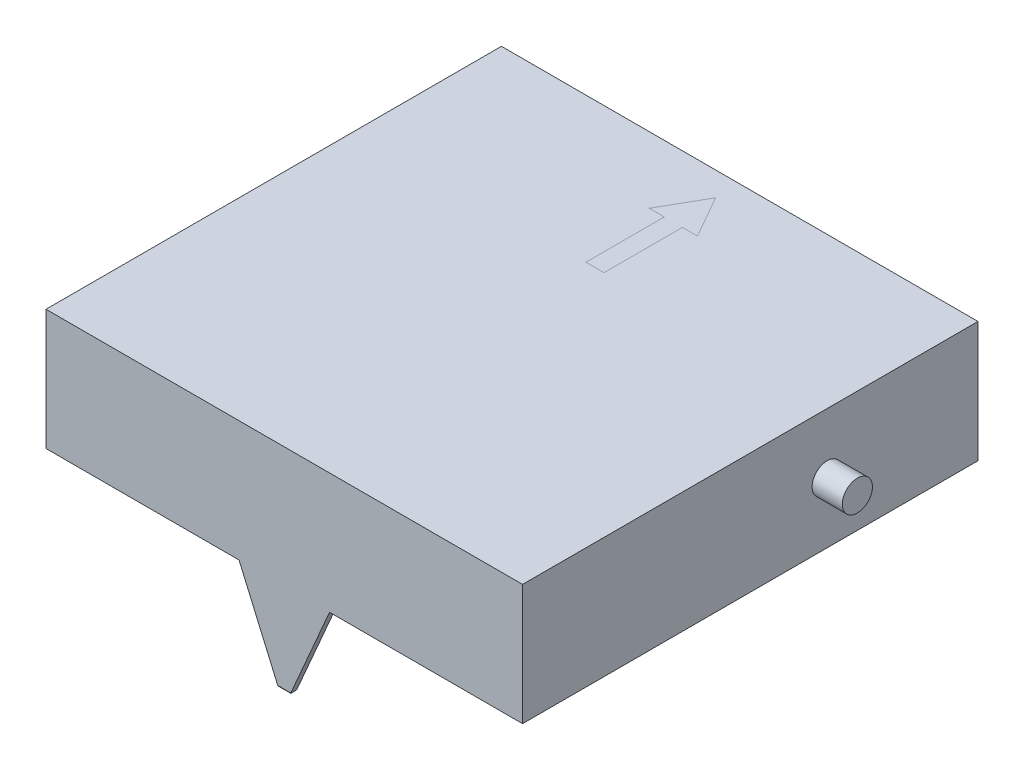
ISO-10303-21;
HEADER;
FILE_DESCRIPTION(('STEP AP214'),'2;1');
FILE_NAME('part.step','',(''),(''),'','','');
FILE_SCHEMA(('AUTOMOTIVE_DESIGN { 1 0 10303 214 1 1 1 1 }'));
ENDSEC;
DATA;
#1=APPLICATION_CONTEXT('core data for automotive mechanical design processes');
#2=APPLICATION_PROTOCOL_DEFINITION('international standard','automotive_design',2000,#1);
#3=PRODUCT_CONTEXT('',#1,'mechanical');
#4=PRODUCT('Part','Part','',(#3));
#5=PRODUCT_RELATED_PRODUCT_CATEGORY('part','',(#4));
#6=PRODUCT_DEFINITION_FORMATION('','',#4);
#7=PRODUCT_DEFINITION_CONTEXT('part definition',#1,'design');
#8=PRODUCT_DEFINITION('design','',#6,#7);
#9=PRODUCT_DEFINITION_SHAPE('','',#8);
#10=(LENGTH_UNIT() NAMED_UNIT(*) SI_UNIT(.MILLI.,.METRE.));
#11=(NAMED_UNIT(*) PLANE_ANGLE_UNIT() SI_UNIT($,.RADIAN.));
#12=(NAMED_UNIT(*) SI_UNIT($,.STERADIAN.) SOLID_ANGLE_UNIT());
#13=UNCERTAINTY_MEASURE_WITH_UNIT(LENGTH_MEASURE(1.E-05),#10,'distance_accuracy_value','');
#14=(GEOMETRIC_REPRESENTATION_CONTEXT(3) GLOBAL_UNCERTAINTY_ASSIGNED_CONTEXT((#13)) GLOBAL_UNIT_ASSIGNED_CONTEXT((#10,
#11,#12)) REPRESENTATION_CONTEXT('',''));
#15=CARTESIAN_POINT('',(0.,0.,0.));
#16=DIRECTION('',(0.,0.,1.));
#17=DIRECTION('',(1.,0.,0.));
#18=AXIS2_PLACEMENT_3D('',#15,#16,#17);
#19=CARTESIAN_POINT('',(0.,20.,0.));
#20=DIRECTION('',(0.,-1.,0.));
#21=DIRECTION('',(0.,0.,-1.));
#22=AXIS2_PLACEMENT_3D('',#19,#20,#21);
#23=PLANE('',#22);
#24=DIRECTION('',(0.,0.,1.));
#25=VECTOR('',#24,1.);
#26=CARTESIAN_POINT('',(0.,20.,0.));
#27=LINE('',#26,#25);
#28=CARTESIAN_POINT('',(0.,20.,-75.5));
#29=VERTEX_POINT('',#28);
#30=CARTESIAN_POINT('',(0.,20.,0.));
#31=VERTEX_POINT('',#30);
#32=EDGE_CURVE('E195',#29,#31,#27,.T.);
#33=ORIENTED_EDGE('',*,*,#32,.T.);
#34=DIRECTION('',(1.,0.,0.));
#35=VECTOR('',#34,1.);
#36=CARTESIAN_POINT('',(0.,20.,0.));
#37=LINE('',#36,#35);
#38=CARTESIAN_POINT('',(79.,20.,0.));
#39=VERTEX_POINT('',#38);
#40=EDGE_CURVE('E199',#31,#39,#37,.T.);
#41=ORIENTED_EDGE('',*,*,#40,.T.);
#42=DIRECTION('',(0.,0.,-1.));
#43=VECTOR('',#42,1.);
#44=CARTESIAN_POINT('',(79.,20.,0.));
#45=LINE('',#44,#43);
#46=CARTESIAN_POINT('',(79.,20.,-75.5));
#47=VERTEX_POINT('',#46);
#48=EDGE_CURVE('E203',#39,#47,#45,.T.);
#49=ORIENTED_EDGE('',*,*,#48,.T.);
#50=DIRECTION('',(-1.,0.,0.));
#51=VECTOR('',#50,1.);
#52=CARTESIAN_POINT('',(0.,20.,-75.5));
#53=LINE('',#52,#51);
#54=EDGE_CURVE('E206',#47,#29,#53,.T.);
#55=ORIENTED_EDGE('',*,*,#54,.T.);
#56=EDGE_LOOP('',(#33,#41,#49,#55));
#57=FACE_BOUND('',#56,.T.);
#58=DIRECTION('',(1.,0.,0.));
#59=VECTOR('',#58,1.);
#60=CARTESIAN_POINT('',(0.,20.,-51.5));
#61=LINE('',#60,#59);
#62=CARTESIAN_POINT('',(38.,20.,-51.5));
#63=VERTEX_POINT('',#62);
#64=CARTESIAN_POINT('',(41.,20.,-51.5));
#65=VERTEX_POINT('',#64);
#66=EDGE_CURVE('E261',#63,#65,#61,.T.);
#67=ORIENTED_EDGE('',*,*,#66,.F.);
#68=DIRECTION('',(0.,0.,1.));
#69=VECTOR('',#68,1.);
#70=CARTESIAN_POINT('',(38.,20.,0.));
#71=LINE('',#70,#69);
#72=CARTESIAN_POINT('',(38.,20.,-64.5));
#73=VERTEX_POINT('',#72);
#74=EDGE_CURVE('E237',#73,#63,#71,.T.);
#75=ORIENTED_EDGE('',*,*,#74,.F.);
#76=DIRECTION('',(1.,0.,0.));
#77=VECTOR('',#76,1.);
#78=CARTESIAN_POINT('',(0.,20.,-64.5));
#79=LINE('',#78,#77);
#80=CARTESIAN_POINT('',(35.5,20.,-64.5));
#81=VERTEX_POINT('',#80);
#82=EDGE_CURVE('E246',#81,#73,#79,.T.);
#83=ORIENTED_EDGE('',*,*,#82,.F.);
#84=DIRECTION('',(-0.496138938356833,0.,0.86824314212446));
#85=VECTOR('',#84,1.);
#86=CARTESIAN_POINT('',(-1.02307692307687,20.,-0.584615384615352));
#87=LINE('',#86,#85);
#88=CARTESIAN_POINT('',(39.5,20.,-71.5));
#89=VERTEX_POINT('',#88);
#90=EDGE_CURVE('E249',#89,#81,#87,.T.);
#91=ORIENTED_EDGE('',*,*,#90,.F.);
#92=DIRECTION('',(-0.496138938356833,0.,-0.86824314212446));
#93=VECTOR('',#92,1.);
#94=CARTESIAN_POINT('',(60.5769230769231,20.,-34.6153846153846));
#95=LINE('',#94,#93);
#96=CARTESIAN_POINT('',(43.5,20.,-64.5));
#97=VERTEX_POINT('',#96);
#98=EDGE_CURVE('E252',#97,#89,#95,.T.);
#99=ORIENTED_EDGE('',*,*,#98,.F.);
#100=DIRECTION('',(1.,0.,0.));
#101=VECTOR('',#100,1.);
#102=CARTESIAN_POINT('',(0.,20.,-64.5));
#103=LINE('',#102,#101);
#104=CARTESIAN_POINT('',(41.,20.,-64.5));
#105=VERTEX_POINT('',#104);
#106=EDGE_CURVE('E255',#105,#97,#103,.T.);
#107=ORIENTED_EDGE('',*,*,#106,.F.);
#108=DIRECTION('',(0.,0.,-1.));
#109=VECTOR('',#108,1.);
#110=CARTESIAN_POINT('',(41.,20.,0.));
#111=LINE('',#110,#109);
#112=EDGE_CURVE('E258',#65,#105,#111,.T.);
#113=ORIENTED_EDGE('',*,*,#112,.F.);
#114=EDGE_LOOP('',(#67,#75,#83,#91,#99,#107,#113));
#115=FACE_BOUND('',#114,.T.);
#116=ADVANCED_FACE('F45',(#57,#115),#23,.F.);
#117=CARTESIAN_POINT('',(0.,20.,0.));
#118=DIRECTION('',(1.,0.,0.));
#119=DIRECTION('',(0.,0.,-1.));
#120=AXIS2_PLACEMENT_3D('',#117,#118,#119);
#121=PLANE('',#120);
#122=CARTESIAN_POINT('',(0.,10.,-50.5));
#123=DIRECTION('',(1.,0.,0.));
#124=DIRECTION('',(0.,0.,-1.));
#125=AXIS2_PLACEMENT_3D('',#122,#123,#124);
#126=CIRCLE('',#125,2.5);
#127=CARTESIAN_POINT('',(0.,10.,-53.));
#128=VERTEX_POINT('',#127);
#129=EDGE_CURVE('E185',#128,#128,#126,.T.);
#130=ORIENTED_EDGE('',*,*,#129,.T.);
#131=EDGE_LOOP('',(#130));
#132=FACE_BOUND('',#131,.T.);
#133=DIRECTION('',(0.,0.,1.));
#134=VECTOR('',#133,1.);
#135=CARTESIAN_POINT('',(0.,0.,0.));
#136=LINE('',#135,#134);
#137=CARTESIAN_POINT('',(0.,0.,-75.5));
#138=VERTEX_POINT('',#137);
#139=CARTESIAN_POINT('',(0.,0.,0.));
#140=VERTEX_POINT('',#139);
#141=EDGE_CURVE('E193',#138,#140,#136,.T.);
#142=ORIENTED_EDGE('',*,*,#141,.T.);
#143=DIRECTION('',(0.,-1.,0.));
#144=VECTOR('',#143,1.);
#145=CARTESIAN_POINT('',(0.,20.,0.));
#146=LINE('',#145,#144);
#147=EDGE_CURVE('E233',#31,#140,#146,.T.);
#148=ORIENTED_EDGE('',*,*,#147,.F.);
#149=ORIENTED_EDGE('',*,*,#32,.F.);
#150=DIRECTION('',(0.,-1.,0.));
#151=VECTOR('',#150,1.);
#152=CARTESIAN_POINT('',(0.,20.,-75.5));
#153=LINE('',#152,#151);
#154=EDGE_CURVE('E209',#29,#138,#153,.T.);
#155=ORIENTED_EDGE('',*,*,#154,.T.);
#156=EDGE_LOOP('',(#142,#148,#149,#155));
#157=FACE_BOUND('',#156,.T.);
#158=ADVANCED_FACE('F333',(#132,#157),#121,.F.);
#159=CARTESIAN_POINT('',(0.,20.,0.));
#160=DIRECTION('',(0.,0.,-1.));
#161=DIRECTION('',(-1.,0.,0.));
#162=AXIS2_PLACEMENT_3D('',#159,#160,#161);
#163=PLANE('',#162);
#164=DIRECTION('',(0.3976074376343,-0.917555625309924,0.));
#165=VECTOR('',#164,1.);
#166=CARTESIAN_POINT('',(32.,0.,0.));
#167=LINE('',#166,#165);
#168=CARTESIAN_POINT('',(32.,0.,0.));
#169=VERTEX_POINT('',#168);
#170=CARTESIAN_POINT('',(38.3916666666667,-14.75,0.));
#171=VERTEX_POINT('',#170);
#172=EDGE_CURVE('E158',#169,#171,#167,.T.);
#173=ORIENTED_EDGE('',*,*,#172,.T.);
#174=DIRECTION('',(1.,0.,0.));
#175=VECTOR('',#174,1.);
#176=CARTESIAN_POINT('',(40.5,-14.75,0.));
#177=LINE('',#176,#175);
#178=CARTESIAN_POINT('',(40.6083333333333,-14.75,0.));
#179=VERTEX_POINT('',#178);
#180=EDGE_CURVE('E12',#171,#179,#177,.T.);
#181=ORIENTED_EDGE('',*,*,#180,.T.);
#182=DIRECTION('',(0.3976074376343,0.917555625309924,0.));
#183=VECTOR('',#182,1.);
#184=CARTESIAN_POINT('',(40.5,-15.,0.));
#185=LINE('',#184,#183);
#186=CARTESIAN_POINT('',(47.,0.,0.));
#187=VERTEX_POINT('',#186);
#188=EDGE_CURVE('E180',#179,#187,#185,.T.);
#189=ORIENTED_EDGE('',*,*,#188,.T.);
#190=DIRECTION('',(1.,0.,0.));
#191=VECTOR('',#190,1.);
#192=CARTESIAN_POINT('',(0.,0.,0.));
#193=LINE('',#192,#191);
#194=CARTESIAN_POINT('',(79.,0.,0.));
#195=VERTEX_POINT('',#194);
#196=EDGE_CURVE('E213',#187,#195,#193,.T.);
#197=ORIENTED_EDGE('',*,*,#196,.T.);
#198=DIRECTION('',(0.,-1.,0.));
#199=VECTOR('',#198,1.);
#200=CARTESIAN_POINT('',(79.,20.,0.));
#201=LINE('',#200,#199);
#202=EDGE_CURVE('E229',#39,#195,#201,.T.);
#203=ORIENTED_EDGE('',*,*,#202,.F.);
#204=ORIENTED_EDGE('',*,*,#40,.F.);
#205=ORIENTED_EDGE('',*,*,#147,.T.);
#206=EDGE_CURVE('E214',#140,#169,#193,.T.);
#207=ORIENTED_EDGE('',*,*,#206,.T.);
#208=EDGE_LOOP('',(#173,#181,#189,#197,#203,#204,#205,#207));
#209=FACE_BOUND('',#208,.T.);
#210=ADVANCED_FACE('F336',(#209),#163,.F.);
#211=CARTESIAN_POINT('',(79.,20.,0.));
#212=DIRECTION('',(-1.,0.,0.));
#213=DIRECTION('',(0.,0.,1.));
#214=AXIS2_PLACEMENT_3D('',#211,#212,#213);
#215=PLANE('',#214);
#216=CARTESIAN_POINT('',(79.,10.,-50.5));
#217=DIRECTION('',(-1.,0.,0.));
#218=DIRECTION('',(0.,0.,1.));
#219=AXIS2_PLACEMENT_3D('',#216,#217,#218);
#220=CIRCLE('',#219,2.5);
#221=CARTESIAN_POINT('',(79.,10.,-48.));
#222=VERTEX_POINT('',#221);
#223=EDGE_CURVE('E238',#222,#222,#220,.T.);
#224=ORIENTED_EDGE('',*,*,#223,.T.);
#225=EDGE_LOOP('',(#224));
#226=FACE_BOUND('',#225,.T.);
#227=DIRECTION('',(0.,0.,-1.));
#228=VECTOR('',#227,1.);
#229=CARTESIAN_POINT('',(79.,0.,0.));
#230=LINE('',#229,#228);
#231=CARTESIAN_POINT('',(79.,0.,-75.5));
#232=VERTEX_POINT('',#231);
#233=EDGE_CURVE('E217',#195,#232,#230,.T.);
#234=ORIENTED_EDGE('',*,*,#233,.T.);
#235=DIRECTION('',(0.,-1.,0.));
#236=VECTOR('',#235,1.);
#237=CARTESIAN_POINT('',(79.,20.,-75.5));
#238=LINE('',#237,#236);
#239=EDGE_CURVE('E225',#47,#232,#238,.T.);
#240=ORIENTED_EDGE('',*,*,#239,.F.);
#241=ORIENTED_EDGE('',*,*,#48,.F.);
#242=ORIENTED_EDGE('',*,*,#202,.T.);
#243=EDGE_LOOP('',(#234,#240,#241,#242));
#244=FACE_BOUND('',#243,.T.);
#245=ADVANCED_FACE('F354',(#226,#244),#215,.F.);
#246=CARTESIAN_POINT('',(0.,20.,-75.5));
#247=DIRECTION('',(0.,0.,1.));
#248=DIRECTION('',(1.,0.,0.));
#249=AXIS2_PLACEMENT_3D('',#246,#247,#248);
#250=PLANE('',#249);
#251=DIRECTION('',(-1.,0.,0.));
#252=VECTOR('',#251,1.);
#253=CARTESIAN_POINT('',(0.,0.,-75.5));
#254=LINE('',#253,#252);
#255=EDGE_CURVE('E200',#232,#138,#254,.T.);
#256=ORIENTED_EDGE('',*,*,#255,.T.);
#257=ORIENTED_EDGE('',*,*,#154,.F.);
#258=ORIENTED_EDGE('',*,*,#54,.F.);
#259=ORIENTED_EDGE('',*,*,#239,.T.);
#260=EDGE_LOOP('',(#256,#257,#258,#259));
#261=FACE_BOUND('',#260,.T.);
#262=ADVANCED_FACE('F352',(#261),#250,.F.);
#263=ORIENTED_EDGE('',*,*,#74,.T.);
#264=ORIENTED_EDGE('',*,*,#66,.T.);
#265=ORIENTED_EDGE('',*,*,#112,.T.);
#266=ORIENTED_EDGE('',*,*,#106,.T.);
#267=ORIENTED_EDGE('',*,*,#98,.T.);
#268=ORIENTED_EDGE('',*,*,#90,.T.);
#269=ORIENTED_EDGE('',*,*,#82,.T.);
#270=EDGE_LOOP('',(#263,#264,#265,#266,#267,#268,#269));
#271=FACE_BOUND('',#270,.T.);
#272=ADVANCED_FACE('F403',(#271),#23,.F.);
#273=CARTESIAN_POINT('',(0.,0.,0.));
#274=DIRECTION('',(0.,-1.,0.));
#275=DIRECTION('',(0.,0.,-1.));
#276=AXIS2_PLACEMENT_3D('',#273,#274,#275);
#277=PLANE('',#276);
#278=DIRECTION('',(0.,0.,1.));
#279=VECTOR('',#278,1.);
#280=CARTESIAN_POINT('',(47.,0.,-1.));
#281=LINE('',#280,#279);
#282=CARTESIAN_POINT('',(47.,0.,-1.));
#283=VERTEX_POINT('',#282);
#284=EDGE_CURVE('E163',#283,#187,#281,.T.);
#285=ORIENTED_EDGE('',*,*,#284,.F.);
#286=DIRECTION('',(-1.,0.,0.));
#287=VECTOR('',#286,1.);
#288=CARTESIAN_POINT('',(32.,0.,-1.));
#289=LINE('',#288,#287);
#290=CARTESIAN_POINT('',(32.,0.,-1.));
#291=VERTEX_POINT('',#290);
#292=EDGE_CURVE('E170',#283,#291,#289,.T.);
#293=ORIENTED_EDGE('',*,*,#292,.T.);
#294=DIRECTION('',(0.,0.,1.));
#295=VECTOR('',#294,1.);
#296=CARTESIAN_POINT('',(32.,0.,-1.));
#297=LINE('',#296,#295);
#298=EDGE_CURVE('E153',#291,#169,#297,.T.);
#299=ORIENTED_EDGE('',*,*,#298,.T.);
#300=ORIENTED_EDGE('',*,*,#206,.F.);
#301=ORIENTED_EDGE('',*,*,#141,.F.);
#302=ORIENTED_EDGE('',*,*,#255,.F.);
#303=ORIENTED_EDGE('',*,*,#233,.F.);
#304=ORIENTED_EDGE('',*,*,#196,.F.);
#305=EDGE_LOOP('',(#285,#293,#299,#300,#301,#302,#303,#304));
#306=FACE_BOUND('',#305,.T.);
#307=ADVANCED_FACE('F176',(#306),#277,.T.);
#308=CARTESIAN_POINT('',(40.5,-15.,-1.));
#309=DIRECTION('',(0.917555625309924,-0.3976074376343,0.));
#310=DIRECTION('',(0.397607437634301,0.917555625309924,0.));
#311=AXIS2_PLACEMENT_3D('',#308,#309,#310);
#312=PLANE('',#311);
#313=DIRECTION('',(0.,0.,1.));
#314=VECTOR('',#313,1.);
#315=CARTESIAN_POINT('',(40.5652591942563,-14.8494018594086,-1.));
#316=LINE('',#315,#314);
#317=CARTESIAN_POINT('',(40.5652591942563,-14.8494018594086,-0.0206110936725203));
#318=VERTEX_POINT('',#317);
#319=CARTESIAN_POINT('',(40.5652591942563,-14.8494018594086,-0.97938890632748));
#320=VERTEX_POINT('',#319);
#321=EDGE_CURVE('E280',#318,#320,#316,.F.);
#322=ORIENTED_EDGE('',*,*,#321,.T.);
#323=CARTESIAN_POINT('',(40.6083333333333,-14.75,-0.75));
#324=DIRECTION('',(0.917555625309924,-0.3976074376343,0.));
#325=DIRECTION('',(-0.397607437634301,-0.917555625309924,0.));
#326=AXIS2_PLACEMENT_3D('',#323,#324,#325);
#327=ELLIPSE('',#326,0.27246304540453,0.25);
#328=CARTESIAN_POINT('',(40.6083333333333,-14.75,-1.));
#329=VERTEX_POINT('',#328);
#330=EDGE_CURVE('E284',#320,#329,#327,.T.);
#331=ORIENTED_EDGE('',*,*,#330,.T.);
#332=DIRECTION('',(0.3976074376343,0.917555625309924,0.));
#333=VECTOR('',#332,1.);
#334=CARTESIAN_POINT('',(40.5,-15.,-1.));
#335=LINE('',#334,#333);
#336=EDGE_CURVE('E164',#329,#283,#335,.T.);
#337=ORIENTED_EDGE('',*,*,#336,.T.);
#338=ORIENTED_EDGE('',*,*,#284,.T.);
#339=ORIENTED_EDGE('',*,*,#188,.F.);
#340=CARTESIAN_POINT('',(40.6083333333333,-14.75,-0.25));
#341=DIRECTION('',(0.917555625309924,-0.3976074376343,0.));
#342=DIRECTION('',(-0.397607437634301,-0.917555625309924,0.));
#343=AXIS2_PLACEMENT_3D('',#340,#341,#342);
#344=ELLIPSE('',#343,0.27246304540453,0.25);
#345=EDGE_CURVE('E277',#179,#318,#344,.T.);
#346=ORIENTED_EDGE('',*,*,#345,.T.);
#347=EDGE_LOOP('',(#322,#331,#337,#338,#339,#346));
#348=FACE_BOUND('',#347,.T.);
#349=ADVANCED_FACE('F381',(#348),#312,.T.);
#350=CARTESIAN_POINT('',(38.5,-15.,-1.));
#351=DIRECTION('',(0.,-1.,0.));
#352=DIRECTION('',(0.,0.,-1.));
#353=AXIS2_PLACEMENT_3D('',#350,#351,#352);
#354=PLANE('',#353);
#355=DIRECTION('',(1.,0.,0.));
#356=VECTOR('',#355,1.);
#357=CARTESIAN_POINT('',(40.5,-15.,-0.75));
#358=LINE('',#357,#356);
#359=CARTESIAN_POINT('',(38.6641297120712,-15.,-0.75));
#360=VERTEX_POINT('',#359);
#361=CARTESIAN_POINT('',(40.3358702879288,-15.,-0.75));
#362=VERTEX_POINT('',#361);
#363=EDGE_CURVE('E270',#360,#362,#358,.T.);
#364=ORIENTED_EDGE('',*,*,#363,.T.);
#365=DIRECTION('',(0.,0.,1.));
#366=VECTOR('',#365,1.);
#367=CARTESIAN_POINT('',(40.3358702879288,-15.,-1.));
#368=LINE('',#367,#366);
#369=CARTESIAN_POINT('',(40.3358702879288,-15.,-0.25));
#370=VERTEX_POINT('',#369);
#371=EDGE_CURVE('E273',#362,#370,#368,.T.);
#372=ORIENTED_EDGE('',*,*,#371,.T.);
#373=DIRECTION('',(1.,0.,0.));
#374=VECTOR('',#373,1.);
#375=CARTESIAN_POINT('',(38.5,-15.,-0.25));
#376=LINE('',#375,#374);
#377=CARTESIAN_POINT('',(38.6641297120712,-15.,-0.25));
#378=VERTEX_POINT('',#377);
#379=EDGE_CURVE('E264',#370,#378,#376,.F.);
#380=ORIENTED_EDGE('',*,*,#379,.T.);
#381=DIRECTION('',(0.,0.,1.));
#382=VECTOR('',#381,1.);
#383=CARTESIAN_POINT('',(38.6641297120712,-15.,-1.));
#384=LINE('',#383,#382);
#385=EDGE_CURVE('E267',#378,#360,#384,.F.);
#386=ORIENTED_EDGE('',*,*,#385,.T.);
#387=EDGE_LOOP('',(#364,#372,#380,#386));
#388=FACE_BOUND('',#387,.T.);
#389=ADVANCED_FACE('F393',(#388),#354,.T.);
#390=CARTESIAN_POINT('',(32.,0.,-1.));
#391=DIRECTION('',(-0.917555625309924,-0.3976074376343,0.));
#392=DIRECTION('',(0.397607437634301,-0.917555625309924,0.));
#393=AXIS2_PLACEMENT_3D('',#390,#391,#392);
#394=PLANE('',#393);
#395=DIRECTION('',(0.3976074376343,-0.917555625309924,0.));
#396=VECTOR('',#395,1.);
#397=CARTESIAN_POINT('',(32.,0.,-1.));
#398=LINE('',#397,#396);
#399=CARTESIAN_POINT('',(38.3916666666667,-14.75,-1.));
#400=VERTEX_POINT('',#399);
#401=EDGE_CURVE('E156',#291,#400,#398,.T.);
#402=ORIENTED_EDGE('',*,*,#401,.T.);
#403=CARTESIAN_POINT('',(38.3916666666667,-14.75,-0.75));
#404=DIRECTION('',(-0.917555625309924,-0.3976074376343,0.));
#405=DIRECTION('',(-0.397607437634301,0.917555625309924,0.));
#406=AXIS2_PLACEMENT_3D('',#403,#404,#405);
#407=ELLIPSE('',#406,0.27246304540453,0.25);
#408=CARTESIAN_POINT('',(38.4347408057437,-14.8494018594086,-0.97938890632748));
#409=VERTEX_POINT('',#408);
#410=EDGE_CURVE('E55',#400,#409,#407,.T.);
#411=ORIENTED_EDGE('',*,*,#410,.T.);
#412=DIRECTION('',(0.,0.,1.));
#413=VECTOR('',#412,1.);
#414=CARTESIAN_POINT('',(38.4347408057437,-14.8494018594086,-1.));
#415=LINE('',#414,#413);
#416=CARTESIAN_POINT('',(38.4347408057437,-14.8494018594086,-0.0206110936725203));
#417=VERTEX_POINT('',#416);
#418=EDGE_CURVE('E66',#409,#417,#415,.T.);
#419=ORIENTED_EDGE('',*,*,#418,.T.);
#420=CARTESIAN_POINT('',(38.3916666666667,-14.75,-0.25));
#421=DIRECTION('',(-0.917555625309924,-0.3976074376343,0.));
#422=DIRECTION('',(-0.397607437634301,0.917555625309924,0.));
#423=AXIS2_PLACEMENT_3D('',#420,#421,#422);
#424=ELLIPSE('',#423,0.27246304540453,0.25);
#425=EDGE_CURVE('E289',#417,#171,#424,.T.);
#426=ORIENTED_EDGE('',*,*,#425,.T.);
#427=ORIENTED_EDGE('',*,*,#172,.F.);
#428=ORIENTED_EDGE('',*,*,#298,.F.);
#429=EDGE_LOOP('',(#402,#411,#419,#426,#427,#428));
#430=FACE_BOUND('',#429,.T.);
#431=ADVANCED_FACE('F155',(#430),#394,.T.);
#432=CARTESIAN_POINT('',(0.,0.,-1.));
#433=DIRECTION('',(0.,0.,1.));
#434=DIRECTION('',(1.,0.,0.));
#435=AXIS2_PLACEMENT_3D('',#432,#433,#434);
#436=PLANE('',#435);
#437=ORIENTED_EDGE('',*,*,#336,.F.);
#438=DIRECTION('',(1.,0.,0.));
#439=VECTOR('',#438,1.);
#440=CARTESIAN_POINT('',(38.5,-14.75,-1.));
#441=LINE('',#440,#439);
#442=EDGE_CURVE('E173',#329,#400,#441,.F.);
#443=ORIENTED_EDGE('',*,*,#442,.T.);
#444=ORIENTED_EDGE('',*,*,#401,.F.);
#445=ORIENTED_EDGE('',*,*,#292,.F.);
#446=EDGE_LOOP('',(#437,#443,#444,#445));
#447=FACE_BOUND('',#446,.T.);
#448=ADVANCED_FACE('F169',(#447),#436,.F.);
#449=CARTESIAN_POINT('',(84.,10.,-50.5));
#450=DIRECTION('',(1.,0.,0.));
#451=DIRECTION('',(0.,0.,-1.));
#452=AXIS2_PLACEMENT_3D('',#449,#450,#451);
#453=PLANE('',#452);
#454=CARTESIAN_POINT('',(84.,10.,-50.5));
#455=DIRECTION('',(1.,0.,0.));
#456=DIRECTION('',(0.,0.,-1.));
#457=AXIS2_PLACEMENT_3D('',#454,#455,#456);
#458=CIRCLE('',#457,2.5);
#459=CARTESIAN_POINT('',(84.,10.,-53.));
#460=VERTEX_POINT('',#459);
#461=EDGE_CURVE('E309',#460,#460,#458,.T.);
#462=ORIENTED_EDGE('',*,*,#461,.T.);
#463=EDGE_LOOP('',(#462));
#464=FACE_BOUND('',#463,.T.);
#465=ADVANCED_FACE('F501',(#464),#453,.T.);
#466=CARTESIAN_POINT('',(-17.0710678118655,10.,-50.5));
#467=DIRECTION('',(1.,0.,0.));
#468=DIRECTION('',(0.,0.,-1.));
#469=AXIS2_PLACEMENT_3D('',#466,#467,#468);
#470=CYLINDRICAL_SURFACE('',#469,2.5);
#471=ORIENTED_EDGE('',*,*,#461,.F.);
#472=EDGE_LOOP('',(#471));
#473=FACE_BOUND('',#472,.T.);
#474=ORIENTED_EDGE('',*,*,#223,.F.);
#475=EDGE_LOOP('',(#474));
#476=FACE_BOUND('',#475,.T.);
#477=ADVANCED_FACE('F327',(#473,#476),#470,.T.);
#478=CARTESIAN_POINT('',(-5.,10.,-50.5));
#479=DIRECTION('',(1.,0.,0.));
#480=DIRECTION('',(0.,0.,-1.));
#481=AXIS2_PLACEMENT_3D('',#478,#479,#480);
#482=CIRCLE('',#481,2.5);
#483=CARTESIAN_POINT('',(-5.,10.,-53.));
#484=VERTEX_POINT('',#483);
#485=EDGE_CURVE('E242',#484,#484,#482,.F.);
#486=ORIENTED_EDGE('',*,*,#485,.F.);
#487=EDGE_LOOP('',(#486));
#488=FACE_BOUND('',#487,.T.);
#489=ORIENTED_EDGE('',*,*,#129,.F.);
#490=EDGE_LOOP('',(#489));
#491=FACE_BOUND('',#490,.T.);
#492=ADVANCED_FACE('F324',(#488,#491),#470,.T.);
#493=CARTESIAN_POINT('',(-5.,20.,0.));
#494=DIRECTION('',(1.,0.,0.));
#495=DIRECTION('',(0.,0.,-1.));
#496=AXIS2_PLACEMENT_3D('',#493,#494,#495);
#497=PLANE('',#496);
#498=ORIENTED_EDGE('',*,*,#485,.T.);
#499=EDGE_LOOP('',(#498));
#500=FACE_BOUND('',#499,.T.);
#501=ADVANCED_FACE('F322',(#500),#497,.F.);
#502=CARTESIAN_POINT('',(38.6641297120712,-14.75,-1.));
#503=DIRECTION('',(0.,0.,1.));
#504=DIRECTION('',(1.,0.,0.));
#505=AXIS2_PLACEMENT_3D('',#502,#503,#504);
#506=CYLINDRICAL_SURFACE('',#505,0.25);
#507=CARTESIAN_POINT('',(38.6641297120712,-14.75,-0.25));
#508=DIRECTION('',(-0.707106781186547,0.,-0.707106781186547));
#509=DIRECTION('',(-0.707106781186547,0.,0.707106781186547));
#510=AXIS2_PLACEMENT_3D('',#507,#508,#509);
#511=ELLIPSE('',#510,0.353553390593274,0.25);
#512=EDGE_CURVE('E301',#417,#378,#511,.F.);
#513=ORIENTED_EDGE('',*,*,#512,.F.);
#514=ORIENTED_EDGE('',*,*,#418,.F.);
#515=CARTESIAN_POINT('',(38.6641297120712,-14.75,-0.75));
#516=DIRECTION('',(-0.707106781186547,0.,0.707106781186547));
#517=DIRECTION('',(0.707106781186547,0.,0.707106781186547));
#518=AXIS2_PLACEMENT_3D('',#515,#516,#517);
#519=ELLIPSE('',#518,0.353553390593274,0.25);
#520=EDGE_CURVE('E49',#360,#409,#519,.F.);
#521=ORIENTED_EDGE('',*,*,#520,.F.);
#522=ORIENTED_EDGE('',*,*,#385,.F.);
#523=EDGE_LOOP('',(#513,#514,#521,#522));
#524=FACE_BOUND('',#523,.T.);
#525=ADVANCED_FACE('F47',(#524),#506,.T.);
#526=CARTESIAN_POINT('',(38.5,-14.75,-0.75));
#527=DIRECTION('',(-1.,0.,0.));
#528=DIRECTION('',(0.,0.,1.));
#529=AXIS2_PLACEMENT_3D('',#526,#527,#528);
#530=CYLINDRICAL_SURFACE('',#529,0.25);
#531=ORIENTED_EDGE('',*,*,#442,.F.);
#532=ORIENTED_EDGE('',*,*,#330,.F.);
#533=CARTESIAN_POINT('',(40.3358702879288,-14.75,-0.75));
#534=DIRECTION('',(-0.707106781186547,0.,-0.707106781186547));
#535=DIRECTION('',(-0.707106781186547,0.,0.707106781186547));
#536=AXIS2_PLACEMENT_3D('',#533,#534,#535);
#537=ELLIPSE('',#536,0.353553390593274,0.25);
#538=EDGE_CURVE('E299',#362,#320,#537,.F.);
#539=ORIENTED_EDGE('',*,*,#538,.F.);
#540=ORIENTED_EDGE('',*,*,#363,.F.);
#541=ORIENTED_EDGE('',*,*,#520,.T.);
#542=ORIENTED_EDGE('',*,*,#410,.F.);
#543=EDGE_LOOP('',(#531,#532,#539,#540,#541,#542));
#544=FACE_BOUND('',#543,.T.);
#545=ADVANCED_FACE('F383',(#544),#530,.T.);
#546=CARTESIAN_POINT('',(0.,-14.75,-0.25));
#547=DIRECTION('',(-1.,0.,0.));
#548=DIRECTION('',(0.,0.,1.));
#549=AXIS2_PLACEMENT_3D('',#546,#547,#548);
#550=CYLINDRICAL_SURFACE('',#549,0.25);
#551=ORIENTED_EDGE('',*,*,#512,.T.);
#552=ORIENTED_EDGE('',*,*,#379,.F.);
#553=CARTESIAN_POINT('',(40.3358702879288,-14.75,-0.25));
#554=DIRECTION('',(-0.707106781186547,0.,0.707106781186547));
#555=DIRECTION('',(-0.707106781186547,0.,-0.707106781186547));
#556=AXIS2_PLACEMENT_3D('',#553,#554,#555);
#557=ELLIPSE('',#556,0.353553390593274,0.25);
#558=EDGE_CURVE('E296',#318,#370,#557,.F.);
#559=ORIENTED_EDGE('',*,*,#558,.F.);
#560=ORIENTED_EDGE('',*,*,#345,.F.);
#561=ORIENTED_EDGE('',*,*,#180,.F.);
#562=ORIENTED_EDGE('',*,*,#425,.F.);
#563=EDGE_LOOP('',(#551,#552,#559,#560,#561,#562));
#564=FACE_BOUND('',#563,.T.);
#565=ADVANCED_FACE('F390',(#564),#550,.T.);
#566=CARTESIAN_POINT('',(40.3358702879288,-14.75,-1.));
#567=DIRECTION('',(0.,0.,1.));
#568=DIRECTION('',(1.,0.,0.));
#569=AXIS2_PLACEMENT_3D('',#566,#567,#568);
#570=CYLINDRICAL_SURFACE('',#569,0.25);
#571=ORIENTED_EDGE('',*,*,#538,.T.);
#572=ORIENTED_EDGE('',*,*,#321,.F.);
#573=ORIENTED_EDGE('',*,*,#558,.T.);
#574=ORIENTED_EDGE('',*,*,#371,.F.);
#575=EDGE_LOOP('',(#571,#572,#573,#574));
#576=FACE_BOUND('',#575,.T.);
#577=ADVANCED_FACE('F389',(#576),#570,.T.);
#578=CLOSED_SHELL('',(#116,#158,#210,#245,#262,#272,#307,#349,#389,#431,#448,#465,#477,#492,
#501,#525,#545,#565,#577));
#579=MANIFOLD_SOLID_BREP('B2',#578);
#580=ADVANCED_BREP_SHAPE_REPRESENTATION('',(#18,#579),#14);
#581=SHAPE_DEFINITION_REPRESENTATION(#9,#580);
ENDSEC;
END-ISO-10303-21;
